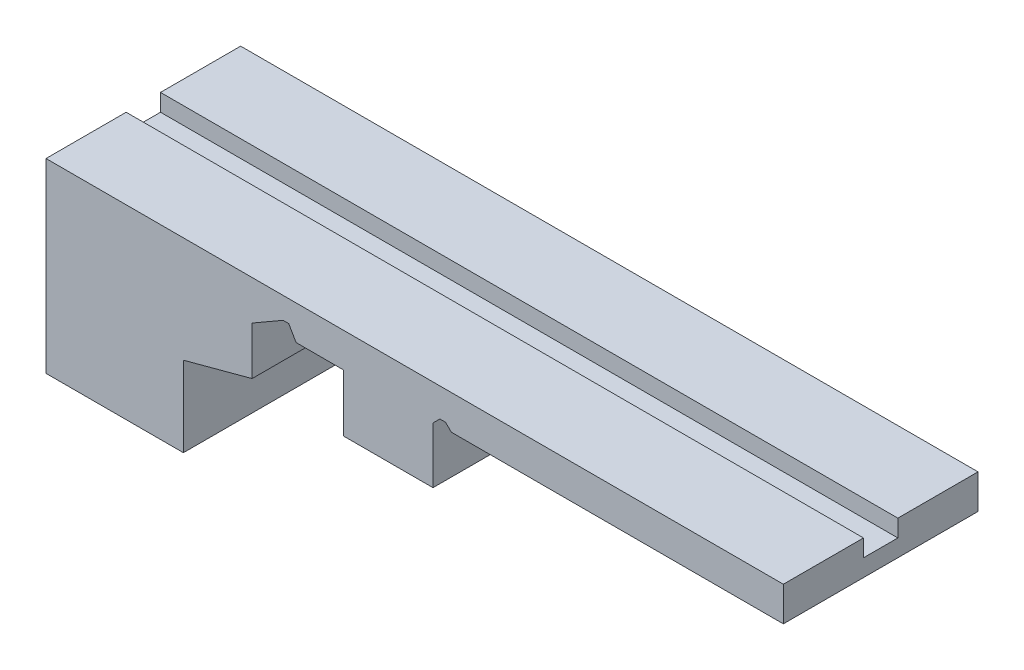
from build123d import *

# Parameters (mm, degrees)
EXTRUSION1_DEPTH        = 170
ESQUISSE2_W             = 30
ESQUISSE2_H             = 15
ENL_V_MAT_EXTRU_1_DEPTH = 680.121891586


with BuildPart() as part:
    # Esquisse1 → Extrusion1 (new body)
    with BuildSketch(Plane.XY):
        Polygon((-49, -50), (29, -50), (29, -1), (35, 5), (40, 5), (45, 0), (335, 0), (335, 30), (-309.002649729, 30), (-309.002649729, -132.541053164), (-189.002649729, -132.541053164), (-189.002649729, -62.541053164), (-129.002649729, -46.464101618), (-129.002649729, -4.464101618), (-102.002649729, 11.12435565), (-97.002649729, 11.12435565), (-90.58, 0), (-49, 0), align=None)
    extrude(amount=EXTRUSION1_DEPTH)

    # Esquisse2 → Enl_v. mat.-Extru.1 (cut, through all)
    with BuildSketch(Plane.ZY.offset(309.002649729)):
        with Locations((85, 22.5)):
            Rectangle(ESQUISSE2_W, ESQUISSE2_H)
    extrude(amount=-ENL_V_MAT_EXTRU_1_DEPTH, mode=Mode.SUBTRACT)


solid = part.part
